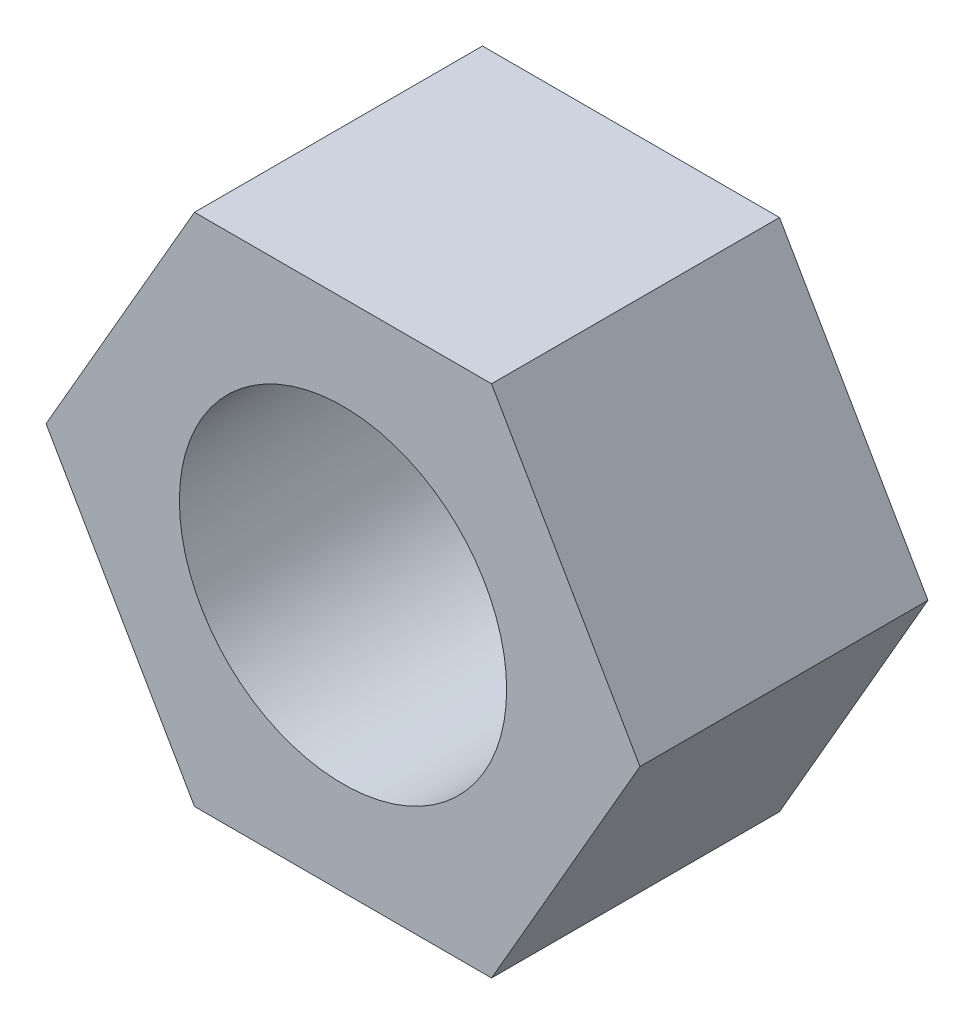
from build123d import *

# Parameters (mm, degrees)
EXTRUDE1_DEPTH     = 9.779
SKETCH2_R          = 5.55625
CUT_EXTRUDE1_DEPTH = 17.542597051


with BuildPart() as part:
    # Sketch1 → Extrude1 (new body)
    with BuildSketch(Plane.XY):
        Polygon((5.043553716, 8.7376), (-5.043553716, 8.7376), (-10.0838, 0), (-5.043553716, -8.7376), (5.043553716, -8.7376), (10.0838, 0), align=None)
    extrude(amount=EXTRUDE1_DEPTH)

    # Sketch2 → Cut-Extrude1 (cut, through all)
    with BuildSketch(Plane.XY.offset(9.779)):
        Circle(SKETCH2_R)
    extrude(amount=-CUT_EXTRUDE1_DEPTH, mode=Mode.SUBTRACT)


solid = part.part
